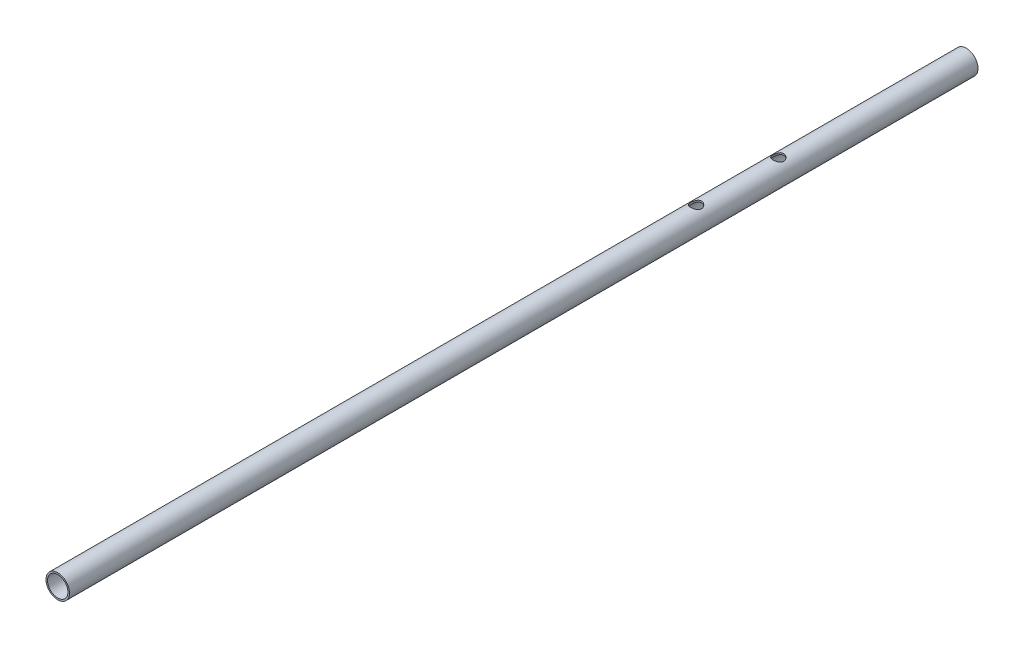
from build123d import *

# Parameters (mm, degrees)
ESQUISSE1_R             = 15
ESQUISSE1_R_2           = 13
EXTRUSION1_DEPTH        = 1160
ESQUISSE2_R             = 7
ENL_V_MAT_EXTRU_1_DEPTH = 40
ESQUISSE3_R             = 4.25
ENL_V_MAT_EXTRU_2_DEPTH = 40


with BuildPart() as part:
    # Esquisse1 → Extrusion1 (new body)
    with BuildSketch(Plane.XY):
        Circle(ESQUISSE1_R)
        Circle(ESQUISSE1_R_2, mode=Mode.SUBTRACT)
    extrude(amount=EXTRUSION1_DEPTH)

    # Esquisse2 → Enl_v. mat.-Extru.1 (cut)
    with BuildSketch(Plane(origin=(0, 0, 0), x_dir=(1, 0, 0), z_dir=(0, 1, 0))):
        with Locations(Location((0, -240, 0), (0, 0, 90))):
            Circle(ESQUISSE2_R)
        with Locations(Location((0, -345, 0), (0, 0, 90))):
            Circle(ESQUISSE2_R)
    extrude(amount=ENL_V_MAT_EXTRU_1_DEPTH, mode=Mode.SUBTRACT)

    # Esquisse3 → Enl_v. mat.-Extru.2 (cut)
    with BuildSketch(Plane(origin=(0, 0, 0), x_dir=(1, 0, 0), z_dir=(0, 1, 0))):
        with Locations(Location((0, -240, 0), (0, 0, 270))):
            Circle(ESQUISSE3_R)
        with Locations(Location((0, -345, 0), (0, 0, 270))):
            Circle(ESQUISSE3_R)
    extrude(amount=-ENL_V_MAT_EXTRU_2_DEPTH, mode=Mode.SUBTRACT)


solid = part.part
